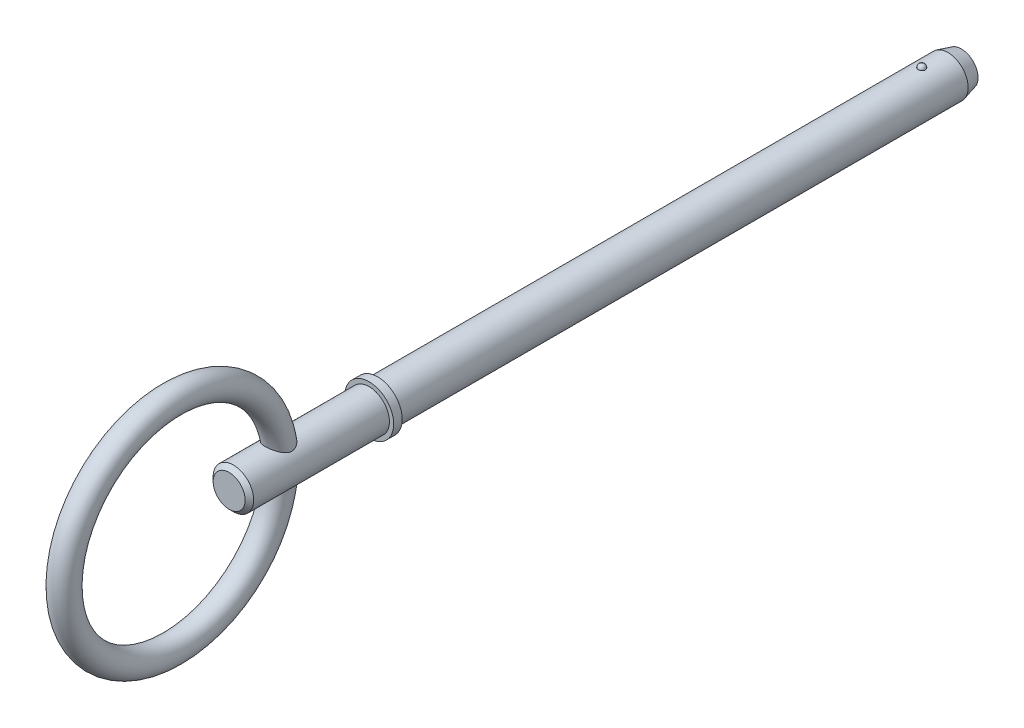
ISO-10303-21;
HEADER;
FILE_DESCRIPTION(('STEP AP214'),'2;1');
FILE_NAME('part.step','',(''),(''),'','','');
FILE_SCHEMA(('AUTOMOTIVE_DESIGN { 1 0 10303 214 1 1 1 1 }'));
ENDSEC;
DATA;
#1=APPLICATION_CONTEXT('core data for automotive mechanical design processes');
#2=APPLICATION_PROTOCOL_DEFINITION('international standard','automotive_design',2000,#1);
#3=PRODUCT_CONTEXT('',#1,'mechanical');
#4=PRODUCT('Part','Part','',(#3));
#5=PRODUCT_RELATED_PRODUCT_CATEGORY('part','',(#4));
#6=PRODUCT_DEFINITION_FORMATION('','',#4);
#7=PRODUCT_DEFINITION_CONTEXT('part definition',#1,'design');
#8=PRODUCT_DEFINITION('design','',#6,#7);
#9=PRODUCT_DEFINITION_SHAPE('','',#8);
#10=(LENGTH_UNIT() NAMED_UNIT(*) SI_UNIT(.MILLI.,.METRE.));
#11=(NAMED_UNIT(*) PLANE_ANGLE_UNIT() SI_UNIT($,.RADIAN.));
#12=(NAMED_UNIT(*) SI_UNIT($,.STERADIAN.) SOLID_ANGLE_UNIT());
#13=UNCERTAINTY_MEASURE_WITH_UNIT(LENGTH_MEASURE(1.E-05),#10,'distance_accuracy_value','');
#14=(GEOMETRIC_REPRESENTATION_CONTEXT(3) GLOBAL_UNCERTAINTY_ASSIGNED_CONTEXT((#13)) GLOBAL_UNIT_ASSIGNED_CONTEXT((#10,
#11,#12)) REPRESENTATION_CONTEXT('',''));
#15=CARTESIAN_POINT('',(0.,0.,0.));
#16=DIRECTION('',(0.,0.,1.));
#17=DIRECTION('',(1.,0.,0.));
#18=AXIS2_PLACEMENT_3D('',#15,#16,#17);
#19=CARTESIAN_POINT('',(0.,0.,63.5));
#20=DIRECTION('',(0.,0.,-1.));
#21=DIRECTION('',(-1.,0.,0.));
#22=AXIS2_PLACEMENT_3D('',#19,#20,#21);
#23=CYLINDRICAL_SURFACE('',#22,2.38);
#24=CARTESIAN_POINT('',(0.418361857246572,2.34294117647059,-0.419999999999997));
#25=CARTESIAN_POINT('',(0.418361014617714,2.34294160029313,-0.396453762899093));
#26=CARTESIAN_POINT('',(0.416399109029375,2.34329426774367,-0.372895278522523));
#27=CARTESIAN_POINT('',(0.408599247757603,2.34466666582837,-0.32643458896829));
#28=CARTESIAN_POINT('',(0.402757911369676,2.34568697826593,-0.303532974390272));
#29=CARTESIAN_POINT('',(0.387358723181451,2.3482789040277,-0.259059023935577));
#30=CARTESIAN_POINT('',(0.377802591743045,2.34985026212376,-0.237486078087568));
#31=CARTESIAN_POINT('',(0.355233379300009,2.35336760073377,-0.196270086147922));
#32=CARTESIAN_POINT('',(0.34222083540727,2.3553135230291,-0.176626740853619));
#33=CARTESIAN_POINT('',(0.313060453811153,2.35936636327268,-0.139777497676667));
#34=CARTESIAN_POINT('',(0.296906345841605,2.36147359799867,-0.122576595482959));
#35=CARTESIAN_POINT('',(0.261921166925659,2.3656092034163,-0.0911421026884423));
#36=CARTESIAN_POINT('',(0.243090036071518,2.36763757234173,-0.0769085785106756));
#37=CARTESIAN_POINT('',(0.203297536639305,2.37138533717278,-0.0518262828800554));
#38=CARTESIAN_POINT('',(0.182338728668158,2.37310509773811,-0.0409735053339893));
#39=CARTESIAN_POINT('',(0.138864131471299,2.37604521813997,-0.0229395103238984));
#40=CARTESIAN_POINT('',(0.116348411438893,2.37726560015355,-0.0157581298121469));
#41=CARTESIAN_POINT('',(0.0705754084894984,2.37906276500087,-0.00531205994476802));
#42=CARTESIAN_POINT('',(0.0473247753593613,2.37964420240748,-0.00201903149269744));
#43=CARTESIAN_POINT('',(0.000593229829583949,2.38011460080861,0.000651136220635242));
#44=CARTESIAN_POINT('',(-0.0228876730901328,2.38000359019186,2.84360175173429E-05));
#45=CARTESIAN_POINT('',(-0.0692686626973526,2.37910422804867,-0.00509943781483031));
#46=CARTESIAN_POINT('',(-0.0921713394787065,2.37831983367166,-0.00958192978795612));
#47=CARTESIAN_POINT('',(-0.136890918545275,2.37616546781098,-0.022272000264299));
#48=CARTESIAN_POINT('',(-0.158707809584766,2.37479549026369,-0.0304796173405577));
#49=CARTESIAN_POINT('',(-0.200704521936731,2.37161607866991,-0.0504168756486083));
#50=CARTESIAN_POINT('',(-0.220879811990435,2.36980547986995,-0.0621558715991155));
#51=CARTESIAN_POINT('',(-0.258974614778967,2.36594575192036,-0.0888218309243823));
#52=CARTESIAN_POINT('',(-0.276894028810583,2.36389661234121,-0.103748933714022));
#53=CARTESIAN_POINT('',(-0.310124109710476,2.35976825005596,-0.136509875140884));
#54=CARTESIAN_POINT('',(-0.325413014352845,2.35768891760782,-0.154365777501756));
#55=CARTESIAN_POINT('',(-0.352793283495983,2.35374782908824,-0.192402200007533));
#56=CARTESIAN_POINT('',(-0.364884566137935,2.35188607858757,-0.212582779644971));
#57=CARTESIAN_POINT('',(-0.385587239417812,2.34858114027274,-0.254794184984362));
#58=CARTESIAN_POINT('',(-0.394183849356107,2.34713973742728,-0.276832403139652));
#59=CARTESIAN_POINT('',(-0.407590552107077,2.3448489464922,-0.322061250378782));
#60=CARTESIAN_POINT('',(-0.412400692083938,2.34399955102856,-0.34525186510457));
#61=CARTESIAN_POINT('',(-0.418098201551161,2.34299005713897,-0.392078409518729));
#62=CARTESIAN_POINT('',(-0.41899328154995,2.34282860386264,-0.415713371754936));
#63=CARTESIAN_POINT('',(-0.416857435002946,2.34320955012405,-0.462799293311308));
#64=CARTESIAN_POINT('',(-0.413826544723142,2.34375194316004,-0.486250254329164));
#65=CARTESIAN_POINT('',(-0.403929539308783,2.34547773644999,-0.532261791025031));
#66=CARTESIAN_POINT('',(-0.397069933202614,2.34666004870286,-0.554823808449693));
#67=CARTESIAN_POINT('',(-0.379705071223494,2.34953208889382,-0.59846383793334));
#68=CARTESIAN_POINT('',(-0.369199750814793,2.35122182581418,-0.61954182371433));
#69=CARTESIAN_POINT('',(-0.344797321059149,2.35492396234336,-0.659671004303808));
#70=CARTESIAN_POINT('',(-0.33089223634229,2.35693711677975,-0.678717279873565));
#71=CARTESIAN_POINT('',(-0.300080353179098,2.36105754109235,-0.714192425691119));
#72=CARTESIAN_POINT('',(-0.283173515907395,2.36316481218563,-0.730621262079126));
#73=CARTESIAN_POINT('',(-0.246801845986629,2.36723962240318,-0.760416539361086));
#74=CARTESIAN_POINT('',(-0.227334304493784,2.36920701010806,-0.773779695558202));
#75=CARTESIAN_POINT('',(-0.186398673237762,2.37277833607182,-0.797042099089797));
#76=CARTESIAN_POINT('',(-0.164930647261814,2.37438228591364,-0.806941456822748));
#77=CARTESIAN_POINT('',(-0.120727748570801,2.37703848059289,-0.82294821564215));
#78=CARTESIAN_POINT('',(-0.0980005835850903,2.37809374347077,-0.829076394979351));
#79=CARTESIAN_POINT('',(-0.0518218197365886,2.37954782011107,-0.837451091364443));
#80=CARTESIAN_POINT('',(-0.0283702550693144,2.37994666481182,-0.839697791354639));
#81=CARTESIAN_POINT('',(0.0184023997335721,2.38004290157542,-0.840243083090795));
#82=CARTESIAN_POINT('',(0.0417231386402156,2.37974556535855,-0.838571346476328));
#83=CARTESIAN_POINT('',(0.0877471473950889,2.37849333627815,-0.831389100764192));
#84=CARTESIAN_POINT('',(0.110450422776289,2.37753844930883,-0.825878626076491));
#85=CARTESIAN_POINT('',(0.154584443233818,2.37507730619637,-0.811179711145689));
#86=CARTESIAN_POINT('',(0.17601599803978,2.37357140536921,-0.801993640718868));
#87=CARTESIAN_POINT('',(0.217028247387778,2.37017355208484,-0.780200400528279));
#88=CARTESIAN_POINT('',(0.236608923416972,2.36828159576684,-0.767593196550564));
#89=CARTESIAN_POINT('',(0.27351405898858,2.36430486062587,-0.739207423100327));
#90=CARTESIAN_POINT('',(0.290821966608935,2.36221883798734,-0.723407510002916));
#91=CARTESIAN_POINT('',(0.322554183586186,2.3580957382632,-0.68912612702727));
#92=CARTESIAN_POINT('',(0.336977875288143,2.35605867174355,-0.670644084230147));
#93=CARTESIAN_POINT('',(0.362636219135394,2.35224677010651,-0.63138169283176));
#94=CARTESIAN_POINT('',(0.373848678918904,2.35047379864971,-0.610586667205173));
#95=CARTESIAN_POINT('',(0.392641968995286,2.34740786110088,-0.567397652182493));
#96=CARTESIAN_POINT('',(0.400225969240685,2.34611447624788,-0.545005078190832));
#97=CARTESIAN_POINT('',(0.410033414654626,2.34441668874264,-0.505456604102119));
#98=CARTESIAN_POINT('',(0.413152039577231,2.34386644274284,-0.488523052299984));
#99=CARTESIAN_POINT('',(0.417316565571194,2.34312853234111,-0.454395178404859));
#100=CARTESIAN_POINT('',(0.418362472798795,2.34294086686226,-0.437200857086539));
#101=CARTESIAN_POINT('',(0.418361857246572,2.34294117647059,-0.419999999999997));
#102=B_SPLINE_CURVE_WITH_KNOTS('',3,(#24,#25,#26,#27,#28,#29,#30,#31,#32,#33,#34,#35,#36,#37,
#38,#39,#40,#41,#42,#43,#44,#45,#46,#47,#48,#49,#50,#51,#52,#53,#54,#55,#56,#57,#58,#59,#60,#61,
#62,#63,#64,#65,#66,#67,#68,#69,#70,#71,#72,#73,#74,#75,#76,#77,#78,#79,#80,#81,#82,#83,#84,#85,
#86,#87,#88,#89,#90,#91,#92,#93,#94,#95,#96,#97,#98,#99,#100,#101),.UNSPECIFIED.,.T.,.F.,(4,2,2,
2,2,2,2,2,2,2,2,2,2,2,2,2,2,2,2,2,2,2,2,2,2,2,2,2,2,2,2,2,2,2,2,2,2,2,4),(0.,0.0705763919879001,
0.141214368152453,0.211819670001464,0.282414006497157,0.353150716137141,0.423889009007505,
0.494543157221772,0.565194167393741,0.635327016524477,0.705456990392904,0.77517764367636,
0.844899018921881,0.914806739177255,0.98471751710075,1.05518143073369,1.1256471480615,
1.19640787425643,1.26716771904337,1.33778814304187,1.40840791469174,1.47890799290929,
1.54940931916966,1.62007764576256,1.69074688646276,1.76149149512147,1.83223384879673,
1.90258285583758,1.97292854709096,2.04274328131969,2.11255738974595,2.18232655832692,
2.25209642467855,2.32234913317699,2.39261687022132,2.4633591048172,2.5340394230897,
2.58559662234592,2.63715366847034),.UNSPECIFIED.);
#103=CARTESIAN_POINT('',(0.418361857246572,2.34294117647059,-0.419999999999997));
#104=VERTEX_POINT('',#103);
#105=EDGE_CURVE('E101',#104,#104,#102,.T.);
#106=ORIENTED_EDGE('',*,*,#105,.T.);
#107=EDGE_LOOP('',(#106));
#108=FACE_BOUND('',#107,.T.);
#109=CARTESIAN_POINT('',(0.,0.,-3.49399999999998));
#110=DIRECTION('',(0.,0.,-1.));
#111=DIRECTION('',(-1.,0.,0.));
#112=AXIS2_PLACEMENT_3D('',#109,#110,#111);
#113=CIRCLE('',#112,2.38);
#114=CARTESIAN_POINT('',(-2.38,0.,-3.49399999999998));
#115=VERTEX_POINT('',#114);
#116=EDGE_CURVE('E109',#115,#115,#113,.F.);
#117=ORIENTED_EDGE('',*,*,#116,.T.);
#118=EDGE_LOOP('',(#117));
#119=FACE_BOUND('',#118,.T.);
#120=CARTESIAN_POINT('',(0.,0.,63.5));
#121=DIRECTION('',(0.,0.,1.));
#122=DIRECTION('',(1.,0.,0.));
#123=AXIS2_PLACEMENT_3D('',#120,#121,#122);
#124=CIRCLE('',#123,2.38);
#125=CARTESIAN_POINT('',(2.38,0.,63.5));
#126=VERTEX_POINT('',#125);
#127=EDGE_CURVE('E107',#126,#126,#124,.T.);
#128=ORIENTED_EDGE('',*,*,#127,.F.);
#129=EDGE_LOOP('',(#128));
#130=FACE_BOUND('',#129,.T.);
#131=ADVANCED_FACE('F39',(#108,#119,#130),#23,.T.);
#132=CARTESIAN_POINT('',(0.,0.,-5.08));
#133=DIRECTION('',(0.,0.,-1.));
#134=DIRECTION('',(-1.,0.,0.));
#135=AXIS2_PLACEMENT_3D('',#132,#133,#134);
#136=PLANE('',#135);
#137=CARTESIAN_POINT('',(0.,0.,-5.08));
#138=DIRECTION('',(0.,0.,-1.));
#139=DIRECTION('',(-1.,0.,0.));
#140=AXIS2_PLACEMENT_3D('',#137,#138,#139);
#141=CIRCLE('',#140,1.95503258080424);
#142=CARTESIAN_POINT('',(-1.95503258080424,0.,-5.08));
#143=VERTEX_POINT('',#142);
#144=EDGE_CURVE('E142',#143,#143,#141,.T.);
#145=ORIENTED_EDGE('',*,*,#144,.T.);
#146=EDGE_LOOP('',(#145));
#147=FACE_BOUND('',#146,.T.);
#148=ADVANCED_FACE('F87',(#147),#136,.T.);
#149=CARTESIAN_POINT('',(0.,0.,-5.08));
#150=DIRECTION('',(0.,0.,1.));
#151=DIRECTION('',(1.,0.,0.));
#152=AXIS2_PLACEMENT_3D('',#149,#150,#151);
#153=CONICAL_SURFACE('',#152,1.95503258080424,0.261799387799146);
#154=ORIENTED_EDGE('',*,*,#116,.F.);
#155=EDGE_LOOP('',(#154));
#156=FACE_BOUND('',#155,.T.);
#157=ORIENTED_EDGE('',*,*,#144,.F.);
#158=EDGE_LOOP('',(#157));
#159=FACE_BOUND('',#158,.T.);
#160=ADVANCED_FACE('F93',(#156,#159),#153,.T.);
#161=CARTESIAN_POINT('',(0.,2.38,-0.419999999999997));
#162=DIRECTION('',(0.,1.,0.));
#163=DIRECTION('',(0.,0.,1.));
#164=AXIS2_PLACEMENT_3D('',#161,#162,#163);
#165=SPHERICAL_SURFACE('',#164,0.419999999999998);
#166=ORIENTED_EDGE('',*,*,#105,.F.);
#167=EDGE_LOOP('',(#166));
#168=FACE_BOUND('',#167,.T.);
#169=ADVANCED_FACE('F112',(#168),#165,.T.);
#170=CARTESIAN_POINT('',(0.,0.,63.5));
#171=DIRECTION('',(0.,0.,-1.));
#172=DIRECTION('',(-1.,0.,0.));
#173=AXIS2_PLACEMENT_3D('',#170,#171,#172);
#174=PLANE('',#173);
#175=ORIENTED_EDGE('',*,*,#127,.T.);
#176=EDGE_LOOP('',(#175));
#177=FACE_BOUND('',#176,.T.);
#178=CARTESIAN_POINT('',(0.,0.,63.5));
#179=DIRECTION('',(0.,0.,-1.));
#180=DIRECTION('',(-1.,0.,0.));
#181=AXIS2_PLACEMENT_3D('',#178,#179,#180);
#182=CIRCLE('',#181,2.88);
#183=CARTESIAN_POINT('',(-2.88,0.,63.5));
#184=VERTEX_POINT('',#183);
#185=EDGE_CURVE('E108',#184,#184,#182,.T.);
#186=ORIENTED_EDGE('',*,*,#185,.T.);
#187=EDGE_LOOP('',(#186));
#188=FACE_BOUND('',#187,.T.);
#189=ADVANCED_FACE('F116',(#177,#188),#174,.T.);
#190=CARTESIAN_POINT('',(0.,0.,33.7287874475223));
#191=DIRECTION('',(0.,0.,-1.));
#192=DIRECTION('',(-1.,0.,0.));
#193=AXIS2_PLACEMENT_3D('',#190,#191,#192);
#194=CYLINDRICAL_SURFACE('',#193,2.88);
#195=CARTESIAN_POINT('',(0.,0.,64.5));
#196=DIRECTION('',(0.,0.,-1.));
#197=DIRECTION('',(-1.,0.,0.));
#198=AXIS2_PLACEMENT_3D('',#195,#196,#197);
#199=CIRCLE('',#198,2.88);
#200=CARTESIAN_POINT('',(-2.88,0.,64.5));
#201=VERTEX_POINT('',#200);
#202=EDGE_CURVE('E133',#201,#201,#199,.T.);
#203=ORIENTED_EDGE('',*,*,#202,.T.);
#204=EDGE_LOOP('',(#203));
#205=FACE_BOUND('',#204,.T.);
#206=ORIENTED_EDGE('',*,*,#185,.F.);
#207=EDGE_LOOP('',(#206));
#208=FACE_BOUND('',#207,.T.);
#209=ADVANCED_FACE('F120',(#205,#208),#194,.T.);
#210=CARTESIAN_POINT('',(0.,2.88,64.5));
#211=DIRECTION('',(0.,0.,1.));
#212=DIRECTION('',(1.,0.,0.));
#213=AXIS2_PLACEMENT_3D('',#210,#211,#212);
#214=PLANE('',#213);
#215=CARTESIAN_POINT('',(0.,0.,64.5));
#216=DIRECTION('',(0.,0.,1.));
#217=DIRECTION('',(1.,0.,0.));
#218=AXIS2_PLACEMENT_3D('',#215,#216,#217);
#219=CIRCLE('',#218,2.38);
#220=CARTESIAN_POINT('',(2.38,0.,64.5));
#221=VERTEX_POINT('',#220);
#222=EDGE_CURVE('E111',#221,#221,#219,.T.);
#223=ORIENTED_EDGE('',*,*,#222,.F.);
#224=EDGE_LOOP('',(#223));
#225=FACE_BOUND('',#224,.T.);
#226=ORIENTED_EDGE('',*,*,#202,.F.);
#227=EDGE_LOOP('',(#226));
#228=FACE_BOUND('',#227,.T.);
#229=ADVANCED_FACE('F84',(#225,#228),#214,.T.);
#230=CARTESIAN_POINT('',(0.,0.,80.95));
#231=DIRECTION('',(0.,0.,-1.));
#232=DIRECTION('',(-1.,0.,0.));
#233=AXIS2_PLACEMENT_3D('',#230,#231,#232);
#234=CYLINDRICAL_SURFACE('',#233,2.38);
#235=CARTESIAN_POINT('',(-0.903407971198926,-2.20187511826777,73.928101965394));
#236=CARTESIAN_POINT('',(-0.839710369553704,-2.22800560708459,73.8836275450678));
#237=CARTESIAN_POINT('',(-0.771955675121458,-2.25255828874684,73.8439200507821));
#238=CARTESIAN_POINT('',(-0.629623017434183,-2.29641711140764,73.7749006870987));
#239=CARTESIAN_POINT('',(-0.555034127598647,-2.31571464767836,73.7456058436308));
#240=CARTESIAN_POINT('',(-0.400673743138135,-2.34735542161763,73.6982943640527));
#241=CARTESIAN_POINT('',(-0.320887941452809,-2.35967847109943,73.6803104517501));
#242=CARTESIAN_POINT('',(-0.158738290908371,-2.37609587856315,73.6564617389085));
#243=CARTESIAN_POINT('',(-0.0763765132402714,-2.38019668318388,73.6505874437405));
#244=CARTESIAN_POINT('',(0.0836658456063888,-2.3797998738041,73.6511603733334));
#245=CARTESIAN_POINT('',(0.161351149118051,-2.37576936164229,73.6569382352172));
#246=CARTESIAN_POINT('',(0.314409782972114,-2.36039486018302,73.6792676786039));
#247=CARTESIAN_POINT('',(0.3897828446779,-2.34905002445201,73.6958205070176));
#248=CARTESIAN_POINT('',(0.535937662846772,-2.32006569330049,73.7390515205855));
#249=CARTESIAN_POINT('',(0.606735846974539,-2.30245039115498,73.7656908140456));
#250=CARTESIAN_POINT('',(0.742521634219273,-2.26231731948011,73.8283720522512));
#251=CARTESIAN_POINT('',(0.807508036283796,-2.23979853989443,73.8644159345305));
#252=CARTESIAN_POINT('',(0.935326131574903,-2.18966592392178,73.9483563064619));
#253=CARTESIAN_POINT('',(0.997591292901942,-2.16179128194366,73.9969595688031));
#254=CARTESIAN_POINT('',(1.11292144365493,-2.10474548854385,74.1035603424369));
#255=CARTESIAN_POINT('',(1.16597568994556,-2.07557287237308,74.1615686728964));
#256=CARTESIAN_POINT('',(1.26477130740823,-2.01699124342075,74.2902977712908));
#257=CARTESIAN_POINT('',(1.30983402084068,-1.98768494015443,74.3615920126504));
#258=CARTESIAN_POINT('',(1.38660631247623,-1.93491744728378,74.5129637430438));
#259=CARTESIAN_POINT('',(1.41834090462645,-1.91144534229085,74.5930244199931));
#260=CARTESIAN_POINT('',(1.46422131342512,-1.87648847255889,74.7506940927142));
#261=CARTESIAN_POINT('',(1.47990731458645,-1.86397592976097,74.8276190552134));
#262=CARTESIAN_POINT('',(1.49871691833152,-1.84889326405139,74.9838974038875));
#263=CARTESIAN_POINT('',(1.50185388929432,-1.84631256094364,75.0632481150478));
#264=CARTESIAN_POINT('',(1.4964844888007,-1.85065563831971,75.2088470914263));
#265=CARTESIAN_POINT('',(1.48970686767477,-1.85616871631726,75.2752204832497));
#266=CARTESIAN_POINT('',(1.46828795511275,-1.87315650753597,75.4059075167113));
#267=CARTESIAN_POINT('',(1.4536391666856,-1.88463690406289,75.4702191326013));
#268=CARTESIAN_POINT('',(1.40943250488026,-1.91806137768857,75.6230643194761));
#269=CARTESIAN_POINT('',(1.37616344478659,-1.94238425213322,75.7099991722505));
#270=CARTESIAN_POINT('',(1.29708737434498,-1.99605834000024,75.8763485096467));
#271=CARTESIAN_POINT('',(1.25125268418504,-2.02542060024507,75.955745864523));
#272=CARTESIAN_POINT('',(1.14695036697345,-2.08629729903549,76.1076285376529));
#273=CARTESIAN_POINT('',(1.08823347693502,-2.11784433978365,76.1799296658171));
#274=CARTESIAN_POINT('',(0.959228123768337,-2.17930599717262,76.3140708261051));
#275=CARTESIAN_POINT('',(0.888958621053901,-2.20922318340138,76.3759276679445));
#276=CARTESIAN_POINT('',(0.753368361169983,-2.25851185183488,76.4749333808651));
#277=CARTESIAN_POINT('',(0.690173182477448,-2.2787729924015,76.5145392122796));
#278=CARTESIAN_POINT('',(0.557409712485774,-2.31482439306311,76.5839846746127));
#279=CARTESIAN_POINT('',(0.48784602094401,-2.3306178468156,76.6138312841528));
#280=CARTESIAN_POINT('',(0.342953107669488,-2.35631858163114,76.6620255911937));
#281=CARTESIAN_POINT('',(0.26757466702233,-2.36616750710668,76.680259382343));
#282=CARTESIAN_POINT('',(0.114199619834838,-2.37849775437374,76.7030468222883));
#283=CARTESIAN_POINT('',(0.0362059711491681,-2.3809871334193,76.7076154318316));
#284=CARTESIAN_POINT('',(-0.107568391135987,-2.37849121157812,76.7030163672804));
#285=CARTESIAN_POINT('',(-0.173440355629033,-2.37456249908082,76.695790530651));
#286=CARTESIAN_POINT('',(-0.302853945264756,-2.36154811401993,76.6716908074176));
#287=CARTESIAN_POINT('',(-0.366395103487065,-2.35246141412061,76.6548149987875));
#288=CARTESIAN_POINT('',(-0.489880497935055,-2.32988758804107,76.6124346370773));
#289=CARTESIAN_POINT('',(-0.549812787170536,-2.31638670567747,76.5869031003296));
#290=CARTESIAN_POINT('',(-0.665021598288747,-2.28597979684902,76.528489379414));
#291=CARTESIAN_POINT('',(-0.720295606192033,-2.26907194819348,76.4956032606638));
#292=CARTESIAN_POINT('',(-0.8511327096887,-2.22413718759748,76.4063110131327));
#293=CARTESIAN_POINT('',(-0.923680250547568,-2.19467168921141,76.3461969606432));
#294=CARTESIAN_POINT('',(-1.05722916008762,-2.13356097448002,76.2150668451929));
#295=CARTESIAN_POINT('',(-1.1182007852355,-2.10191042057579,76.1440235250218));
#296=CARTESIAN_POINT('',(-1.22894457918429,-2.0391654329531,75.9916118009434));
#297=CARTESIAN_POINT('',(-1.27853191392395,-2.00808682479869,75.9101025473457));
#298=CARTESIAN_POINT('',(-1.36422650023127,-1.95088121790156,75.7387530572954));
#299=CARTESIAN_POINT('',(-1.40036235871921,-1.9247437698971,75.6489310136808));
#300=CARTESIAN_POINT('',(-1.44943039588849,-1.88791548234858,75.4877392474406));
#301=CARTESIAN_POINT('',(-1.46600167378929,-1.87495651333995,75.4180059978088));
#302=CARTESIAN_POINT('',(-1.48984634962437,-1.8560704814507,75.2760551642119));
#303=CARTESIAN_POINT('',(-1.49713400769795,-1.85013263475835,75.203841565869));
#304=CARTESIAN_POINT('',(-1.5014924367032,-1.84660099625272,75.0583634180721));
#305=CARTESIAN_POINT('',(-1.4984943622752,-1.84906342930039,74.9850950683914));
#306=CARTESIAN_POINT('',(-1.48179888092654,-1.8624661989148,74.8405680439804));
#307=CARTESIAN_POINT('',(-1.46809860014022,-1.87340881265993,74.769309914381));
#308=CARTESIAN_POINT('',(-1.43218989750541,-1.90096973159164,74.6372815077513));
#309=CARTESIAN_POINT('',(-1.410850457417,-1.91699396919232,74.5761429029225));
#310=CARTESIAN_POINT('',(-1.36038958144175,-1.95312601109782,74.4584385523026));
#311=CARTESIAN_POINT('',(-1.33126141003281,-1.97323734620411,74.4018768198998));
#312=CARTESIAN_POINT('',(-1.26173108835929,-2.0185059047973,74.2870500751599));
#313=CARTESIAN_POINT('',(-1.22036168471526,-2.04397945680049,74.2294985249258));
#314=CARTESIAN_POINT('',(-1.1295425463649,-2.09553139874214,74.1216488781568));
#315=CARTESIAN_POINT('',(-1.08010424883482,-2.12160888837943,74.0713407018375));
#316=CARTESIAN_POINT('',(-0.987769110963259,-2.16578285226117,73.9904848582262));
#317=CARTESIAN_POINT('',(-0.946517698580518,-2.18419033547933,73.9582016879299));
#318=CARTESIAN_POINT('',(-0.903407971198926,-2.20187511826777,73.928101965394));
#319=B_SPLINE_CURVE_WITH_KNOTS('',3,(#235,#236,#237,#238,#239,#240,#241,#242,#243,#244,#245,
#246,#247,#248,#249,#250,#251,#252,#253,#254,#255,#256,#257,#258,#259,#260,#261,#262,#263,#264,
#265,#266,#267,#268,#269,#270,#271,#272,#273,#274,#275,#276,#277,#278,#279,#280,#281,#282,#283,
#284,#285,#286,#287,#288,#289,#290,#291,#292,#293,#294,#295,#296,#297,#298,#299,#300,#301,#302,
#303,#304,#305,#306,#307,#308,#309,#310,#311,#312,#313,#314,#315,#316,#317,#318),.UNSPECIFIED.,
.T.,.F.,(4,2,2,2,2,2,2,2,2,2,2,2,2,2,2,2,2,2,2,2,2,2,2,2,2,2,2,2,2,2,2,2,2,2,2,2,2,2,2,2,2,4),
(0.,0.245727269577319,0.49185450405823,0.738690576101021,0.985333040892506,1.21821047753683,
1.45111486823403,1.68313021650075,1.9151934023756,2.16541572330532,2.41592795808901,
2.68235417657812,2.9482781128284,3.18521517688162,3.42189976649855,3.62191159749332,
3.82211427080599,4.10918949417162,4.39690224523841,4.69076958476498,4.98415935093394,
5.2151557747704,5.4459866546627,5.67904815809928,5.91185441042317,6.11003726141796,
6.30825959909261,6.50710565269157,6.70605834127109,7.00062466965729,7.29593791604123,
7.59575158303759,7.89492395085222,8.11262207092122,8.32998539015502,8.54880641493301,
8.76768621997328,8.96702101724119,9.16652875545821,9.39164791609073,9.61645071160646,
9.78275580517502),.UNSPECIFIED.);
#320=CARTESIAN_POINT('',(-0.903407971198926,-2.20187511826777,73.928101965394));
#321=VERTEX_POINT('',#320);
#322=EDGE_CURVE('E10',#321,#321,#319,.T.);
#323=ORIENTED_EDGE('',*,*,#322,.F.);
#324=EDGE_LOOP('',(#323));
#325=FACE_BOUND('',#324,.T.);
#326=CARTESIAN_POINT('',(-0.903407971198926,2.20187511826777,73.928101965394));
#327=CARTESIAN_POINT('',(-0.970214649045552,2.17445928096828,73.9747550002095));
#328=CARTESIAN_POINT('',(-1.03268838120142,2.14525344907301,74.0267440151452));
#329=CARTESIAN_POINT('',(-1.1477077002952,2.0859961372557,74.1406478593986));
#330=CARTESIAN_POINT('',(-1.20022114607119,2.05594226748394,74.2025936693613));
#331=CARTESIAN_POINT('',(-1.2941155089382,1.99817720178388,74.3359266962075));
#332=CARTESIAN_POINT('',(-1.33544720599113,1.9704767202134,74.4073536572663));
#333=CARTESIAN_POINT('',(-1.40506760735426,1.92146090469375,74.5582024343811));
#334=CARTESIAN_POINT('',(-1.43339046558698,1.90012890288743,74.6376026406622));
#335=CARTESIAN_POINT('',(-1.47338334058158,1.86925714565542,74.7934496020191));
#336=CARTESIAN_POINT('',(-1.48649837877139,1.85870842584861,74.8693198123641));
#337=CARTESIAN_POINT('',(-1.50071746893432,1.8472518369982,75.02287045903));
#338=CARTESIAN_POINT('',(-1.50182784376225,1.84633889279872,75.1005499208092));
#339=CARTESIAN_POINT('',(-1.49326645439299,1.85325786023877,75.243985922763));
#340=CARTESIAN_POINT('',(-1.48506604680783,1.85989666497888,75.3099043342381));
#341=CARTESIAN_POINT('',(-1.46099386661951,1.87886395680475,75.4394790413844));
#342=CARTESIAN_POINT('',(-1.44511553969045,1.8911973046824,75.5031333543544));
#343=CARTESIAN_POINT('',(-1.39754250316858,1.92678855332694,75.6561538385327));
#344=CARTESIAN_POINT('',(-1.36192725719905,1.95245999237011,75.7437372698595));
#345=CARTESIAN_POINT('',(-1.27788657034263,2.00847209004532,75.9109907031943));
#346=CARTESIAN_POINT('',(-1.22943137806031,2.0388235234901,75.9906417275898));
#347=CARTESIAN_POINT('',(-1.11958027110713,2.10119412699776,76.1424206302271));
#348=CARTESIAN_POINT('',(-1.05794784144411,2.13323438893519,76.2143690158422));
#349=CARTESIAN_POINT('',(-0.922772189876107,2.1950849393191,76.3470807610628));
#350=CARTESIAN_POINT('',(-0.84925261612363,2.22489948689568,76.4078658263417));
#351=CARTESIAN_POINT('',(-0.710152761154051,2.27246326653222,76.5023110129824));
#352=CARTESIAN_POINT('',(-0.647015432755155,2.29138112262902,76.5389704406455));
#353=CARTESIAN_POINT('',(-0.514878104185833,2.32463484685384,76.6025884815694));
#354=CARTESIAN_POINT('',(-0.445882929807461,2.33897444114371,76.6295549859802));
#355=CARTESIAN_POINT('',(-0.302797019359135,2.36177853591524,76.6721624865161));
#356=CARTESIAN_POINT('',(-0.228666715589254,2.37019011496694,76.6877015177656));
#357=CARTESIAN_POINT('',(-0.0783799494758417,2.37989644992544,76.7056164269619));
#358=CARTESIAN_POINT('',(-0.00222521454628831,2.38119708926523,76.7080031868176));
#359=CARTESIAN_POINT('',(0.138818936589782,2.37685303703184,76.6999981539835));
#360=CARTESIAN_POINT('',(0.203841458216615,2.37212211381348,76.6912876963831));
#361=CARTESIAN_POINT('',(0.331347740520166,2.35769527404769,76.6645309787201));
#362=CARTESIAN_POINT('',(0.393830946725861,2.34799827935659,76.6464826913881));
#363=CARTESIAN_POINT('',(0.516206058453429,2.32419976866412,76.6016833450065));
#364=CARTESIAN_POINT('',(0.576015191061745,2.31000942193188,76.5747562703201));
#365=CARTESIAN_POINT('',(0.690806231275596,2.27831963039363,76.5136110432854));
#366=CARTESIAN_POINT('',(0.745785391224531,2.26081831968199,76.479388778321));
#367=CARTESIAN_POINT('',(0.876071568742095,2.2144370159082,76.3866108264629));
#368=CARTESIAN_POINT('',(0.948236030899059,2.18416686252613,76.324322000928));
#369=CARTESIAN_POINT('',(1.08068664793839,2.121767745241,76.1888044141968));
#370=CARTESIAN_POINT('',(1.14094076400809,2.08963406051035,76.115547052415));
#371=CARTESIAN_POINT('',(1.24978363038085,2.02643655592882,75.958659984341));
#372=CARTESIAN_POINT('',(1.29819307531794,1.99539463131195,75.8748968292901));
#373=CARTESIAN_POINT('',(1.38094965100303,1.93904233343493,75.6989962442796));
#374=CARTESIAN_POINT('',(1.41533296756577,1.91371728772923,75.6068811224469));
#375=CARTESIAN_POINT('',(1.46011713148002,1.87962907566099,75.443926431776));
#376=CARTESIAN_POINT('',(1.47459501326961,1.86818653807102,75.3747778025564));
#377=CARTESIAN_POINT('',(1.49436605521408,1.8524142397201,75.234403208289));
#378=CARTESIAN_POINT('',(1.49967306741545,1.84807375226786,75.1631805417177));
#379=CARTESIAN_POINT('',(1.50029887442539,1.84756805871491,75.0202291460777));
#380=CARTESIAN_POINT('',(1.49556248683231,1.8514480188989,74.948499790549));
#381=CARTESIAN_POINT('',(1.47581657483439,1.86722196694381,74.8073512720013));
#382=CARTESIAN_POINT('',(1.46080121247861,1.87912050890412,74.7379334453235));
#383=CARTESIAN_POINT('',(1.42246467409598,1.90827733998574,74.6082199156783));
#384=CARTESIAN_POINT('',(1.39980172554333,1.92509995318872,74.5476260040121));
#385=CARTESIAN_POINT('',(1.34679091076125,1.96255086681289,74.4311857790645));
#386=CARTESIAN_POINT('',(1.31644034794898,1.98318050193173,74.3753411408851));
#387=CARTESIAN_POINT('',(1.24396057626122,2.02954647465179,74.2614514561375));
#388=CARTESIAN_POINT('',(1.20077385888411,2.05559269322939,74.2042068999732));
#389=CARTESIAN_POINT('',(1.10616417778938,2.10801594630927,74.0971320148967));
#390=CARTESIAN_POINT('',(1.05473535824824,2.13439320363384,74.0473070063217));
#391=CARTESIAN_POINT('',(0.93620270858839,2.18924478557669,73.9487347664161));
#392=CARTESIAN_POINT('',(0.867904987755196,2.21744450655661,73.9012583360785));
#393=CARTESIAN_POINT('',(0.722917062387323,2.26885521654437,73.8177494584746));
#394=CARTESIAN_POINT('',(0.64622728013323,2.29206645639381,73.7817164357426));
#395=CARTESIAN_POINT('',(0.487515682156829,2.33094430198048,73.722591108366));
#396=CARTESIAN_POINT('',(0.405587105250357,2.34671524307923,73.6993190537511));
#397=CARTESIAN_POINT('',(0.237955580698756,2.36958127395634,73.6658521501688));
#398=CARTESIAN_POINT('',(0.152255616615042,2.37668309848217,73.6556471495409));
#399=CARTESIAN_POINT('',(-0.0122990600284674,2.38126478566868,73.6490505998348));
#400=CARTESIAN_POINT('',(-0.0910885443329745,2.37954037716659,73.6515167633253));
#401=CARTESIAN_POINT('',(-0.247004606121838,2.36843740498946,73.6675699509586));
#402=CARTESIAN_POINT('',(-0.324130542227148,2.35905594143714,73.6811611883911));
#403=CARTESIAN_POINT('',(-0.473048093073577,2.33371594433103,73.7185984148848));
#404=CARTESIAN_POINT('',(-0.544914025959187,2.31788812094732,73.7422409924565));
#405=CARTESIAN_POINT('',(-0.683201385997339,2.28095222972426,73.7990265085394));
#406=CARTESIAN_POINT('',(-0.749631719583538,2.25985303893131,73.8321534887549));
#407=CARTESIAN_POINT('',(-0.843767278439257,2.22565914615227,73.8880726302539));
#408=CARTESIAN_POINT('',(-0.8740072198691,2.21394047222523,73.9075705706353));
#409=CARTESIAN_POINT('',(-0.903407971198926,2.20187511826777,73.928101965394));
#410=B_SPLINE_CURVE_WITH_KNOTS('',3,(#326,#327,#328,#329,#330,#331,#332,#333,#334,#335,#336,
#337,#338,#339,#340,#341,#342,#343,#344,#345,#346,#347,#348,#349,#350,#351,#352,#353,#354,#355,
#356,#357,#358,#359,#360,#361,#362,#363,#364,#365,#366,#367,#368,#369,#370,#371,#372,#373,#374,
#375,#376,#377,#378,#379,#380,#381,#382,#383,#384,#385,#386,#387,#388,#389,#390,#391,#392,#393,
#394,#395,#396,#397,#398,#399,#400,#401,#402,#403,#404,#405,#406,#407,#408,#409),.UNSPECIFIED.,
.T.,.F.,(4,2,2,2,2,2,2,2,2,2,2,2,2,2,2,2,2,2,2,2,2,2,2,2,2,2,2,2,2,2,2,2,2,2,2,2,2,2,2,2,2,4),
(0.,0.25781569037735,0.516449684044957,0.776204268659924,1.03527292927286,1.26692758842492,
1.49846022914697,1.69794041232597,1.89759118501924,2.1899309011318,2.48295401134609,
2.78175997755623,3.07997865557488,3.30539912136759,3.53063565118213,3.75785831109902,
3.98489294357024,4.18128296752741,4.37771564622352,4.57830350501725,4.77900474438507,
5.07746482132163,5.37671714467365,5.68025255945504,5.982999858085,6.19688795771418,
6.41045270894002,6.62519390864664,6.84005717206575,7.03981304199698,7.23963907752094,
7.46764796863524,7.69581957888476,7.95804669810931,8.22026062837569,8.47867938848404,
8.73689726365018,8.97226876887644,9.20772945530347,9.43863631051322,9.66915690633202,
9.7826182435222),.UNSPECIFIED.);
#411=CARTESIAN_POINT('',(-0.903407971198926,2.20187511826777,73.928101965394));
#412=VERTEX_POINT('',#411);
#413=EDGE_CURVE('E51',#412,#412,#410,.T.);
#414=ORIENTED_EDGE('',*,*,#413,.F.);
#415=EDGE_LOOP('',(#414));
#416=FACE_BOUND('',#415,.T.);
#417=CARTESIAN_POINT('',(0.,0.,80.45));
#418=DIRECTION('',(0.,0.,-1.));
#419=DIRECTION('',(-1.,0.,0.));
#420=AXIS2_PLACEMENT_3D('',#417,#418,#419);
#421=CIRCLE('',#420,2.38);
#422=CARTESIAN_POINT('',(-2.38,0.,80.45));
#423=VERTEX_POINT('',#422);
#424=EDGE_CURVE('E63',#423,#423,#421,.T.);
#425=ORIENTED_EDGE('',*,*,#424,.T.);
#426=EDGE_LOOP('',(#425));
#427=FACE_BOUND('',#426,.T.);
#428=ORIENTED_EDGE('',*,*,#222,.T.);
#429=EDGE_LOOP('',(#428));
#430=FACE_BOUND('',#429,.T.);
#431=ADVANCED_FACE('F68',(#325,#416,#427,#430),#234,.T.);
#432=CARTESIAN_POINT('',(0.,0.,80.95));
#433=DIRECTION('',(0.,0.,-1.));
#434=DIRECTION('',(-1.,0.,0.));
#435=AXIS2_PLACEMENT_3D('',#432,#433,#434);
#436=PLANE('',#435);
#437=CARTESIAN_POINT('',(0.,0.,80.95));
#438=DIRECTION('',(0.,0.,-1.));
#439=DIRECTION('',(-1.,0.,0.));
#440=AXIS2_PLACEMENT_3D('',#437,#438,#439);
#441=CIRCLE('',#440,1.88000000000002);
#442=CARTESIAN_POINT('',(-1.88000000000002,0.,80.95));
#443=VERTEX_POINT('',#442);
#444=EDGE_CURVE('E58',#443,#443,#441,.F.);
#445=ORIENTED_EDGE('',*,*,#444,.T.);
#446=EDGE_LOOP('',(#445));
#447=FACE_BOUND('',#446,.T.);
#448=ADVANCED_FACE('F75',(#447),#436,.F.);
#449=CARTESIAN_POINT('',(0.,0.,80.45));
#450=DIRECTION('',(0.,0.,-1.));
#451=DIRECTION('',(-1.,0.,0.));
#452=AXIS2_PLACEMENT_3D('',#449,#450,#451);
#453=CONICAL_SURFACE('',#452,2.38,0.785398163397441);
#454=ORIENTED_EDGE('',*,*,#444,.F.);
#455=EDGE_LOOP('',(#454));
#456=FACE_BOUND('',#455,.T.);
#457=ORIENTED_EDGE('',*,*,#424,.F.);
#458=EDGE_LOOP('',(#457));
#459=FACE_BOUND('',#458,.T.);
#460=ADVANCED_FACE('F41',(#456,#459),#453,.T.);
#461=CARTESIAN_POINT('',(0.,0.,87.65));
#462=DIRECTION('',(1.,0.,0.));
#463=DIRECTION('',(0.,0.,-1.));
#464=AXIS2_PLACEMENT_3D('',#461,#462,#463);
#465=TOROIDAL_SURFACE('',#464,12.7,1.5);
#466=ORIENTED_EDGE('',*,*,#322,.T.);
#467=EDGE_LOOP('',(#466));
#468=FACE_BOUND('',#467,.T.);
#469=ORIENTED_EDGE('',*,*,#413,.T.);
#470=EDGE_LOOP('',(#469));
#471=FACE_BOUND('',#470,.T.);
#472=ADVANCED_FACE('F72',(#468,#471),#465,.T.);
#473=CLOSED_SHELL('',(#131,#148,#160,#169,#189,#209,#229,#431,#448,#460,#472));
#474=MANIFOLD_SOLID_BREP('B2',#473);
#475=ADVANCED_BREP_SHAPE_REPRESENTATION('',(#18,#474),#14);
#476=SHAPE_DEFINITION_REPRESENTATION(#9,#475);
ENDSEC;
END-ISO-10303-21;
